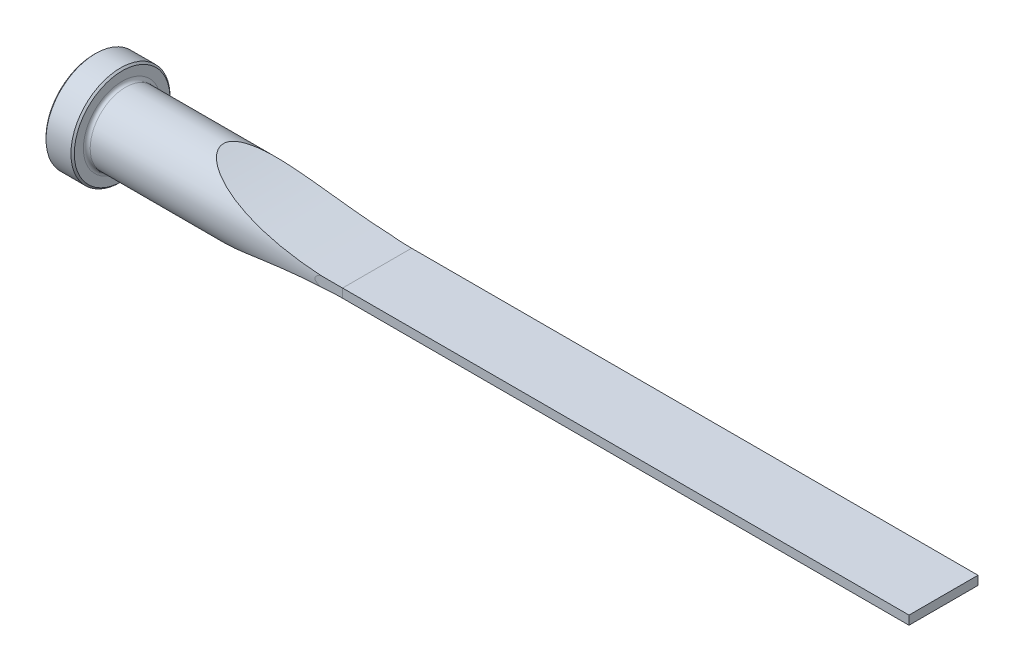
ISO-10303-21;
HEADER;
FILE_DESCRIPTION(('STEP AP214'),'2;1');
FILE_NAME('part.step','',(''),(''),'','','');
FILE_SCHEMA(('AUTOMOTIVE_DESIGN { 1 0 10303 214 1 1 1 1 }'));
ENDSEC;
DATA;
#1=APPLICATION_CONTEXT('core data for automotive mechanical design processes');
#2=APPLICATION_PROTOCOL_DEFINITION('international standard','automotive_design',2000,#1);
#3=PRODUCT_CONTEXT('',#1,'mechanical');
#4=PRODUCT('Part','Part','',(#3));
#5=PRODUCT_RELATED_PRODUCT_CATEGORY('part','',(#4));
#6=PRODUCT_DEFINITION_FORMATION('','',#4);
#7=PRODUCT_DEFINITION_CONTEXT('part definition',#1,'design');
#8=PRODUCT_DEFINITION('design','',#6,#7);
#9=PRODUCT_DEFINITION_SHAPE('','',#8);
#10=(LENGTH_UNIT() NAMED_UNIT(*) SI_UNIT(.MILLI.,.METRE.));
#11=(NAMED_UNIT(*) PLANE_ANGLE_UNIT() SI_UNIT($,.RADIAN.));
#12=(NAMED_UNIT(*) SI_UNIT($,.STERADIAN.) SOLID_ANGLE_UNIT());
#13=UNCERTAINTY_MEASURE_WITH_UNIT(LENGTH_MEASURE(1.E-05),#10,'distance_accuracy_value','');
#14=(GEOMETRIC_REPRESENTATION_CONTEXT(3) GLOBAL_UNCERTAINTY_ASSIGNED_CONTEXT((#13)) GLOBAL_UNIT_ASSIGNED_CONTEXT((#10,
#11,#12)) REPRESENTATION_CONTEXT('',''));
#15=CARTESIAN_POINT('',(0.,0.,0.));
#16=DIRECTION('',(0.,0.,1.));
#17=DIRECTION('',(1.,0.,0.));
#18=AXIS2_PLACEMENT_3D('',#15,#16,#17);
#19=CARTESIAN_POINT('',(0.,0.,0.));
#20=DIRECTION('',(-1.,0.,0.));
#21=DIRECTION('',(0.,0.,1.));
#22=AXIS2_PLACEMENT_3D('',#19,#20,#21);
#23=CYLINDRICAL_SURFACE('',#22,7.9375);
#24=CARTESIAN_POINT('',(7.112,0.,0.));
#25=DIRECTION('',(-1.,0.,0.));
#26=DIRECTION('',(0.,0.,1.));
#27=AXIS2_PLACEMENT_3D('',#24,#25,#26);
#28=CIRCLE('',#27,7.9375);
#29=CARTESIAN_POINT('',(7.112,0.,7.9375));
#30=VERTEX_POINT('',#29);
#31=EDGE_CURVE('E153',#30,#30,#28,.F.);
#32=ORIENTED_EDGE('',*,*,#31,.T.);
#33=EDGE_LOOP('',(#32));
#34=FACE_BOUND('',#33,.T.);
#35=CARTESIAN_POINT('',(63.5,1.78451947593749,7.73429999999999));
#36=CARTESIAN_POINT('',(63.3430656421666,1.78451054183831,7.73429977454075));
#37=CARTESIAN_POINT('',(63.1861350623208,1.78271922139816,7.73471557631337));
#38=CARTESIAN_POINT('',(62.8723492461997,1.77549817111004,7.73637727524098));
#39=CARTESIAN_POINT('',(62.7154940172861,1.77006813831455,7.73762324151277));
#40=CARTESIAN_POINT('',(62.2441822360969,1.74816345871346,7.74261393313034));
#41=CARTESIAN_POINT('',(61.9299817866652,1.72607327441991,7.74761144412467));
#42=CARTESIAN_POINT('',(61.2899690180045,1.66408626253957,7.76117477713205));
#43=CARTESIAN_POINT('',(60.9642250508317,1.62347858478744,7.76988203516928));
#44=CARTESIAN_POINT('',(60.4785569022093,1.5460805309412,7.78551205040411));
#45=CARTESIAN_POINT('',(60.3172623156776,1.51755721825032,7.79114576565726));
#46=CARTESIAN_POINT('',(59.995978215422,1.45411431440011,7.80323762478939));
#47=CARTESIAN_POINT('',(59.8359884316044,1.41919608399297,7.80969559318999));
#48=CARTESIAN_POINT('',(59.5504331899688,1.34959366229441,7.82198684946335));
#49=CARTESIAN_POINT('',(59.4245187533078,1.31632189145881,7.82767781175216));
#50=CARTESIAN_POINT('',(59.1742906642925,1.24389463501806,7.83951454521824));
#51=CARTESIAN_POINT('',(59.0499782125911,1.20473498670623,7.84566063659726));
#52=CARTESIAN_POINT('',(58.8046106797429,1.11932874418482,7.85829914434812));
#53=CARTESIAN_POINT('',(58.6835409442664,1.07312433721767,7.86478935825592));
#54=CARTESIAN_POINT('',(58.4455290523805,0.971242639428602,7.87802451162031));
#55=CARTESIAN_POINT('',(58.3285807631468,0.915580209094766,7.88476903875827));
#56=CARTESIAN_POINT('',(58.1332020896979,0.807942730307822,7.89640344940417));
#57=CARTESIAN_POINT('',(58.0530253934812,0.759165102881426,7.90129316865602));
#58=CARTESIAN_POINT('',(57.8993862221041,0.652026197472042,7.9108592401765));
#59=CARTESIAN_POINT('',(57.8258979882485,0.593704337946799,7.91553637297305));
#60=CARTESIAN_POINT('',(57.7277467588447,0.498492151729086,7.9218877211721));
#61=CARTESIAN_POINT('',(57.6980303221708,0.466875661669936,7.92382750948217));
#62=CARTESIAN_POINT('',(57.6425603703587,0.400245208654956,7.92747295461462));
#63=CARTESIAN_POINT('',(57.6168066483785,0.365231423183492,7.92917862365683));
#64=CARTESIAN_POINT('',(57.5744097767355,0.297054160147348,7.93200146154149));
#65=CARTESIAN_POINT('',(57.5569814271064,0.264389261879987,7.9331684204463));
#66=CARTESIAN_POINT('',(57.5276907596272,0.196640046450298,7.93513574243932));
#67=CARTESIAN_POINT('',(57.5158172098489,0.161560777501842,7.9359368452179));
#68=CARTESIAN_POINT('',(57.5003815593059,0.0956953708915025,7.93697969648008));
#69=CARTESIAN_POINT('',(57.4957692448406,0.0651593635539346,7.93729206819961));
#70=CARTESIAN_POINT('',(57.491836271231,0.00374737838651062,7.93755838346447));
#71=CARTESIAN_POINT('',(57.4925133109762,-0.0271284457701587,7.9375124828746));
#72=CARTESIAN_POINT('',(57.4990749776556,-0.0882381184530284,7.93706831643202));
#73=CARTESIAN_POINT('',(57.5049486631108,-0.118473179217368,7.936670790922));
#74=CARTESIAN_POINT('',(57.5213031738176,-0.177660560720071,7.93556691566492));
#75=CARTESIAN_POINT('',(57.5317886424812,-0.206611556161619,7.9348602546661));
#76=CARTESIAN_POINT('',(57.5626598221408,-0.276684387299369,7.93278744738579));
#77=CARTESIAN_POINT('',(57.5853777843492,-0.316766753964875,7.93126793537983));
#78=CARTESIAN_POINT('',(57.6366991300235,-0.39292597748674,7.92786070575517));
#79=CARTESIAN_POINT('',(57.6653178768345,-0.428991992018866,7.92597202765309));
#80=CARTESIAN_POINT('',(57.7519576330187,-0.525999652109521,7.92030384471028));
#81=CARTESIAN_POINT('',(57.8146458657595,-0.582701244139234,7.91625752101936));
#82=CARTESIAN_POINT('',(57.946996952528,-0.687133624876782,7.90787418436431));
#83=CARTESIAN_POINT('',(58.0166818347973,-0.73483462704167,7.90353626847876));
#84=CARTESIAN_POINT('',(58.1980649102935,-0.847009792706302,7.89247512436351));
#85=CARTESIAN_POINT('',(58.3124942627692,-0.90701549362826,7.88570351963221));
#86=CARTESIAN_POINT('',(58.5463942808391,-1.0164466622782,7.87233944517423));
#87=CARTESIAN_POINT('',(58.6658758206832,-1.06584775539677,7.86574741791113));
#88=CARTESIAN_POINT('',(58.9089635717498,-1.15711870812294,7.85284174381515));
#89=CARTESIAN_POINT('',(59.0325981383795,-1.19891277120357,7.8465313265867));
#90=CARTESIAN_POINT('',(59.2816923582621,-1.27609049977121,7.83434823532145));
#91=CARTESIAN_POINT('',(59.4071499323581,-1.31148093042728,7.82847510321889));
#92=CARTESIAN_POINT('',(59.6993409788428,-1.38743337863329,7.81542475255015));
#93=CARTESIAN_POINT('',(59.8665757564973,-1.42608925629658,7.8084228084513));
#94=CARTESIAN_POINT('',(60.2026202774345,-1.49607651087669,7.79531303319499));
#95=CARTESIAN_POINT('',(60.3714304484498,-1.52740583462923,7.78920545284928));
#96=CARTESIAN_POINT('',(60.8800454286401,-1.61220099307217,7.77226680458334));
#97=CARTESIAN_POINT('',(61.2214646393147,-1.65633549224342,7.76284544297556));
#98=CARTESIAN_POINT('',(61.8861149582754,-1.72271499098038,7.74836524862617));
#99=CARTESIAN_POINT('',(62.2092344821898,-1.74609496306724,7.74308238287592));
#100=CARTESIAN_POINT('',(62.6938210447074,-1.76925595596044,7.73780942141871));
#101=CARTESIAN_POINT('',(62.8550077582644,-1.77499180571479,7.73649365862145));
#102=CARTESIAN_POINT('',(63.1774617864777,-1.78261828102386,7.73473885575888));
#103=CARTESIAN_POINT('',(63.3387290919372,-1.78450927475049,7.73429973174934));
#104=CARTESIAN_POINT('',(63.5,-1.78451947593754,7.73429999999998));
#105=B_SPLINE_CURVE_WITH_KNOTS('',3,(#35,#36,#37,#38,#39,#40,#41,#42,#43,#44,#45,#46,#47,#48,
#49,#50,#51,#52,#53,#54,#55,#56,#57,#58,#59,#60,#61,#62,#63,#64,#65,#66,#67,#68,#69,#70,#71,#72,
#73,#74,#75,#76,#77,#78,#79,#80,#81,#82,#83,#84,#85,#86,#87,#88,#89,#90,#91,#92,#93,#94,#95,#96,
#97,#98,#99,#100,#101,#102,#103,#104),.UNSPECIFIED.,.F.,.F.,(4,2,2,2,2,2,2,2,2,2,2,2,2,2,2,2,2,
2,2,2,2,2,2,2,2,2,2,2,2,2,2,2,2,2,4),(0.,0.470784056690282,0.941607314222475,1.886257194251,
2.87069717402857,3.36228091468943,3.85376017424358,4.24473219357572,4.63598193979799,
5.02497459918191,5.41336162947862,5.69491367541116,5.97533094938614,6.10540702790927,
6.23547631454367,6.34621180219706,6.45672240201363,6.54894631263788,6.64113010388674,
6.7331202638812,6.82520325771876,6.96270105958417,7.10056147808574,7.3530071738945,
7.60627419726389,7.99346510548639,8.38153665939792,8.77328533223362,9.16461769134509,
9.67975694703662,10.1950403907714,11.2273641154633,12.1989586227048,12.6827980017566,
13.1665910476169),.UNSPECIFIED.);
#106=CARTESIAN_POINT('',(58.7970394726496,1.11508444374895,7.85878444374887));
#107=VERTEX_POINT('',#106);
#108=CARTESIAN_POINT('',(58.7970394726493,-1.11508444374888,7.85878444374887));
#109=VERTEX_POINT('',#108);
#110=EDGE_CURVE('E156',#107,#109,#105,.T.);
#111=ORIENTED_EDGE('',*,*,#110,.F.);
#112=CARTESIAN_POINT('',(63.5,0.990599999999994,7.8754439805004));
#113=CARTESIAN_POINT('',(62.8367092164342,0.990598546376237,7.87539803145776));
#114=CARTESIAN_POINT('',(62.1734175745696,0.998023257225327,7.87450855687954));
#115=CARTESIAN_POINT('',(60.8471654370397,1.027714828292,7.87071326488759));
#116=CARTESIAN_POINT('',(60.1842049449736,1.04998184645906,7.86780742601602));
#117=CARTESIAN_POINT('',(58.8585953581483,1.10936428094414,7.85964784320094));
#118=CARTESIAN_POINT('',(58.1959466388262,1.14648790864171,7.85439280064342));
#119=CARTESIAN_POINT('',(56.8716784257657,1.23556206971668,7.84087600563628));
#120=CARTESIAN_POINT('',(56.2100589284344,1.28751255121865,7.83261426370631));
#121=CARTESIAN_POINT('',(54.8847773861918,1.40651744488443,7.81212374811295));
#122=CARTESIAN_POINT('',(54.2211225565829,1.47364883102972,7.79987461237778));
#123=CARTESIAN_POINT('',(52.8956050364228,1.62281646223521,7.77020977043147));
#124=CARTESIAN_POINT('',(52.2337423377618,1.70485263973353,7.75279408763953));
#125=CARTESIAN_POINT('',(50.9124394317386,1.88373867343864,7.71128161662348));
#126=CARTESIAN_POINT('',(50.2529985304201,1.98058388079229,7.68718692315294));
#127=CARTESIAN_POINT('',(48.9368236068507,2.18901625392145,7.63045191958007));
#128=CARTESIAN_POINT('',(48.2800895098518,2.30060300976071,7.59781184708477));
#129=CARTESIAN_POINT('',(47.140821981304,2.50736667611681,7.5316339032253));
#130=CARTESIAN_POINT('',(46.657542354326,2.59922942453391,7.50055200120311));
#131=CARTESIAN_POINT('',(45.6930605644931,2.79086047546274,7.43137874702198));
#132=CARTESIAN_POINT('',(45.211858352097,2.89062858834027,7.39328756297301));
#133=CARTESIAN_POINT('',(44.251620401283,3.0980238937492,7.30880978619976));
#134=CARTESIAN_POINT('',(43.7725858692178,3.20565499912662,7.26241904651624));
#135=CARTESIAN_POINT('',(42.8173515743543,3.4285934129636,7.15986832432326));
#136=CARTESIAN_POINT('',(42.3411517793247,3.54390063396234,7.10370845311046));
#137=CARTESIAN_POINT('',(41.3908811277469,3.78231096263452,6.97969485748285));
#138=CARTESIAN_POINT('',(40.9168190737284,3.9054336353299,6.91181098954));
#139=CARTESIAN_POINT('',(39.9727565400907,4.15893910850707,6.76230752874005));
#140=CARTESIAN_POINT('',(39.5027563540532,4.28932242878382,6.68068695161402));
#141=CARTESIAN_POINT('',(38.5683216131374,4.55680045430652,6.50118449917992));
#142=CARTESIAN_POINT('',(38.1038817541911,4.69388800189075,6.40331971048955));
#143=CARTESIAN_POINT('',(37.181486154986,4.9743000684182,6.18801717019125));
#144=CARTESIAN_POINT('',(36.7235290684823,5.11762326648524,6.07058354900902));
#145=CARTESIAN_POINT('',(36.0402364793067,5.33748269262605,5.87578702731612));
#146=CARTESIAN_POINT('',(35.8117252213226,5.41204203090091,5.80728075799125));
#147=CARTESIAN_POINT('',(35.3572536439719,5.56235396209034,5.66347586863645));
#148=CARTESIAN_POINT('',(35.1312931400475,5.63810646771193,5.58817774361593));
#149=CARTESIAN_POINT('',(34.6820897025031,5.79069284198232,5.42990609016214));
#150=CARTESIAN_POINT('',(34.4588504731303,5.86752793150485,5.34692318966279));
#151=CARTESIAN_POINT('',(34.0159717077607,6.02191062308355,5.17243400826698));
#152=CARTESIAN_POINT('',(33.796332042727,6.09945819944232,5.08092803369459));
#153=CARTESIAN_POINT('',(33.3632897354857,6.25423767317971,4.88911832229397));
#154=CARTESIAN_POINT('',(33.1498497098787,6.33146655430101,4.78889696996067));
#155=CARTESIAN_POINT('',(32.7282271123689,6.48581366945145,4.57769006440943));
#156=CARTESIAN_POINT('',(32.5200455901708,6.56293187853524,4.46670238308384));
#157=CARTESIAN_POINT('',(32.1108396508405,6.71621550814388,4.2327153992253));
#158=CARTESIAN_POINT('',(31.9097999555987,6.7923827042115,4.10974414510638));
#159=CARTESIAN_POINT('',(31.5163812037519,6.9430116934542,3.84981399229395));
#160=CARTESIAN_POINT('',(31.3239968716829,7.01747451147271,3.71286378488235));
#161=CARTESIAN_POINT('',(31.0168987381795,7.13750403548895,3.47431658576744));
#162=CARTESIAN_POINT('',(30.8988621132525,7.18394265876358,3.37743358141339));
#163=CARTESIAN_POINT('',(30.6684957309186,7.27511925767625,3.17627937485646));
#164=CARTESIAN_POINT('',(30.5561667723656,7.31985699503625,3.07200714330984));
#165=CARTESIAN_POINT('',(30.3386213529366,7.40698540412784,2.8555334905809));
#166=CARTESIAN_POINT('',(30.2333982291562,7.44937826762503,2.74333970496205));
#167=CARTESIAN_POINT('',(30.0316535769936,7.53107328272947,2.51039195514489));
#168=CARTESIAN_POINT('',(29.9351284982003,7.57037669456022,2.38964151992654));
#169=CARTESIAN_POINT('',(29.7184357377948,7.65901103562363,2.09185418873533));
#170=CARTESIAN_POINT('',(29.6030268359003,7.70655492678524,1.91072625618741));
#171=CARTESIAN_POINT('',(29.3995091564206,7.79079045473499,1.53135329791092));
#172=CARTESIAN_POINT('',(29.3113595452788,7.82749831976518,1.33313444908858));
#173=CARTESIAN_POINT('',(29.1825898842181,7.88127500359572,0.958459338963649));
#174=CARTESIAN_POINT('',(29.136340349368,7.90066111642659,0.784297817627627));
#175=CARTESIAN_POINT('',(29.0715916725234,7.92782806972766,0.43001484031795));
#176=CARTESIAN_POINT('',(29.0530686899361,7.9356188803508,0.249898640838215));
#177=CARTESIAN_POINT('',(29.0455549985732,7.93877728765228,-0.111437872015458));
#178=CARTESIAN_POINT('',(29.0566234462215,7.93411999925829,-0.292659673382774));
#179=CARTESIAN_POINT('',(29.1072867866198,7.91284701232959,-0.650347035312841));
#180=CARTESIAN_POINT('',(29.1469020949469,7.89622275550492,-0.82680909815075));
#181=CARTESIAN_POINT('',(29.2629907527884,7.84767250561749,-1.20959062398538));
#182=CARTESIAN_POINT('',(29.3457719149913,7.8131368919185,-1.41364149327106));
#183=CARTESIAN_POINT('',(29.5408366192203,7.73223905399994,-1.80457425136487));
#184=CARTESIAN_POINT('',(29.6531770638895,7.68585402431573,-1.99142207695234));
#185=CARTESIAN_POINT('',(29.8721592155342,7.5960735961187,-2.3074181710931));
#186=CARTESIAN_POINT('',(29.9744606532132,7.55432796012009,-2.44012749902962));
#187=CARTESIAN_POINT('',(30.1896236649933,7.46704570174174,-2.6954307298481));
#188=CARTESIAN_POINT('',(30.3024914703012,7.42150684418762,-2.81801858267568));
#189=CARTESIAN_POINT('',(30.536738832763,7.32759763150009,-3.0539097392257));
#190=CARTESIAN_POINT('',(30.6581307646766,7.2792231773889,-3.16719900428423));
#191=CARTESIAN_POINT('',(30.9076763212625,7.18045252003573,-3.38515963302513));
#192=CARTESIAN_POINT('',(31.0358325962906,7.13005552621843,-3.48982757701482));
#193=CARTESIAN_POINT('',(31.4212726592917,6.97956546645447,-3.7865569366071));
#194=CARTESIAN_POINT('',(31.6861649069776,6.87750341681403,-3.96776311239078));
#195=CARTESIAN_POINT('',(32.2302200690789,6.67103578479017,-4.30585220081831));
#196=CARTESIAN_POINT('',(32.5093967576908,6.56662799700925,-4.46271102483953));
#197=CARTESIAN_POINT('',(33.0786496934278,6.35711199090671,-4.75643046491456));
#198=CARTESIAN_POINT('',(33.3687493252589,6.25200271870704,-4.89324470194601));
#199=CARTESIAN_POINT('',(33.8095769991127,6.09493680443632,-5.08551469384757));
#200=CARTESIAN_POINT('',(33.957440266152,6.0426900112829,-5.14743668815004));
#201=CARTESIAN_POINT('',(34.2548758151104,5.93848549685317,-5.26731527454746));
#202=CARTESIAN_POINT('',(34.4044481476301,5.8865277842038,-5.32527174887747));
#203=CARTESIAN_POINT('',(34.7824145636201,5.75637249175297,-5.46639393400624));
#204=CARTESIAN_POINT('',(35.0117794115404,5.67842450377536,-5.54719284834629));
#205=CARTESIAN_POINT('',(35.4733998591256,5.52366932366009,-5.70130566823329));
#206=CARTESIAN_POINT('',(35.705655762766,5.4468622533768,-5.77461877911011));
#207=CARTESIAN_POINT('',(36.4062522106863,5.21840848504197,-5.98456770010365));
#208=CARTESIAN_POINT('',(36.878278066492,5.06877868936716,-6.11116079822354));
#209=CARTESIAN_POINT('',(37.8304026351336,4.77579215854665,-6.34275624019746));
#210=CARTESIAN_POINT('',(38.3105145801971,4.63244744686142,-6.44771851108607));
#211=CARTESIAN_POINT('',(39.2763103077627,4.35303209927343,-6.63955707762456));
#212=CARTESIAN_POINT('',(39.7619931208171,4.21696022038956,-6.7264364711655));
#213=CARTESIAN_POINT('',(40.7414562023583,3.95156312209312,-6.88572178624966));
#214=CARTESIAN_POINT('',(41.2352697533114,3.82229487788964,-6.95801656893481));
#215=CARTESIAN_POINT('',(42.226656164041,3.57190994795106,-7.08980746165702));
#216=CARTESIAN_POINT('',(42.7242291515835,3.45079354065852,-7.14930313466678));
#217=CARTESIAN_POINT('',(43.7220057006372,3.21705592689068,-7.25748028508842));
#218=CARTESIAN_POINT('',(44.222206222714,3.10442654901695,-7.30617225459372));
#219=CARTESIAN_POINT('',(45.2252509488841,2.8876871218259,-7.39451476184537));
#220=CARTESIAN_POINT('',(45.7280952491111,2.78357738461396,-7.43416496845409));
#221=CARTESIAN_POINT('',(46.9494839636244,2.541729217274,-7.52106100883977));
#222=CARTESIAN_POINT('',(47.6691864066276,2.40842257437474,-7.56441165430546));
#223=CARTESIAN_POINT('',(49.1122741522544,2.15953627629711,-7.63918584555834));
#224=CARTESIAN_POINT('',(49.8356596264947,2.04395745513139,-7.67060883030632));
#225=CARTESIAN_POINT('',(51.2857943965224,1.83061714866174,-7.72430255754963));
#226=CARTESIAN_POINT('',(52.0125453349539,1.73286557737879,-7.74656821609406));
#227=CARTESIAN_POINT('',(53.4684192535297,1.55535689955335,-7.7841503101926));
#228=CARTESIAN_POINT('',(54.1975422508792,1.47559992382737,-7.79946669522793));
#229=CARTESIAN_POINT('',(55.6399868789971,1.33585716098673,-7.82459607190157));
#230=CARTESIAN_POINT('',(56.3532646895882,1.27544026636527,-7.83453308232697));
#231=CARTESIAN_POINT('',(57.7811125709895,1.17184940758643,-7.85069558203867));
#232=CARTESIAN_POINT('',(58.4956826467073,1.12867550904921,-7.85692105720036));
#233=CARTESIAN_POINT('',(59.9250100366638,1.05963193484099,-7.86653071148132));
#234=CARTESIAN_POINT('',(60.6397665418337,1.03374601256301,-7.86991755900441));
#235=CARTESIAN_POINT('',(61.7121983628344,1.00785903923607,-7.87325790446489));
#236=CARTESIAN_POINT('',(62.0697257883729,1.00138703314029,-7.87408136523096));
#237=CARTESIAN_POINT('',(62.7848342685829,0.992757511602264,-7.87517298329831));
#238=CARTESIAN_POINT('',(63.1424153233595,0.990600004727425,-7.8754411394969));
#239=CARTESIAN_POINT('',(63.4999999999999,0.990599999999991,-7.8754439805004));
#240=B_SPLINE_CURVE_WITH_KNOTS('',3,(#112,#113,#114,#115,#116,#117,#118,#119,#120,#121,#122,
#123,#124,#125,#126,#127,#128,#129,#130,#131,#132,#133,#134,#135,#136,#137,#138,#139,#140,#141,
#142,#143,#144,#145,#146,#147,#148,#149,#150,#151,#152,#153,#154,#155,#156,#157,#158,#159,#160,
#161,#162,#163,#164,#165,#166,#167,#168,#169,#170,#171,#172,#173,#174,#175,#176,#177,#178,#179,
#180,#181,#182,#183,#184,#185,#186,#187,#188,#189,#190,#191,#192,#193,#194,#195,#196,#197,#198,
#199,#200,#201,#202,#203,#204,#205,#206,#207,#208,#209,#210,#211,#212,#213,#214,#215,#216,#217,
#218,#219,#220,#221,#222,#223,#224,#225,#226,#227,#228,#229,#230,#231,#232,#233,#234,#235,#236,
#237,#238,#239),.UNSPECIFIED.,.F.,.F.,(4,2,2,2,2,2,2,2,2,2,2,2,2,2,2,2,2,2,2,2,2,2,2,2,2,2,2,2,
2,2,2,2,2,2,2,2,2,2,2,2,2,2,2,2,2,2,2,2,2,2,2,2,2,2,2,2,2,2,2,2,2,2,2,4),(0.,1.98983159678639,
3.97968436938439,5.97063847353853,7.96158561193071,9.96286356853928,11.9641324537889,
13.9647743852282,15.9653606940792,17.4439981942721,18.9226002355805,20.4019431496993,
21.8812692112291,23.3644569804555,24.8477510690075,26.3294947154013,27.8109260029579,
28.5606563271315,29.3103320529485,30.0609344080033,30.8115097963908,31.5556334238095,
32.2999044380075,33.0424734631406,33.7845835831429,34.2631819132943,34.7418470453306,
35.2200569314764,35.6980707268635,36.3558379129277,37.0126149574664,37.5540056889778,
38.0949306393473,38.6369377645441,39.1793328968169,39.8443461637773,40.5106490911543,
41.0279992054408,41.545656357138,42.0640811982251,42.5827106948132,43.5913087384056,
44.6008983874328,45.6127883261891,46.1185610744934,46.6243488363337,47.3902949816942,
48.1563223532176,49.6888577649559,51.2242073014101,52.7592935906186,54.3056691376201,
55.8520974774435,57.3970173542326,58.9419938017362,61.1413024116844,63.3407144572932,
65.5413459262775,67.7419933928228,69.8894745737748,72.0369639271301,74.1824322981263,
75.2551703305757,76.3279104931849),.UNSPECIFIED.);
#241=CARTESIAN_POINT('',(58.7970394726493,1.11508444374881,-7.85878444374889));
#242=VERTEX_POINT('',#241);
#243=EDGE_CURVE('E106',#107,#242,#240,.T.);
#244=ORIENTED_EDGE('',*,*,#243,.T.);
#245=CARTESIAN_POINT('',(63.5,1.78451947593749,-7.73429999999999));
#246=CARTESIAN_POINT('',(63.3430656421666,1.78451054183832,-7.73429977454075));
#247=CARTESIAN_POINT('',(63.1861350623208,1.78271922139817,-7.73471557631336));
#248=CARTESIAN_POINT('',(62.8723492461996,1.77549817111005,-7.73637727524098));
#249=CARTESIAN_POINT('',(62.715494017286,1.77006813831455,-7.73762324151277));
#250=CARTESIAN_POINT('',(62.2441822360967,1.74816345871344,-7.74261393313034));
#251=CARTESIAN_POINT('',(61.929981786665,1.72607327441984,-7.74761144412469));
#252=CARTESIAN_POINT('',(61.2899690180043,1.66408626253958,-7.76117477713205));
#253=CARTESIAN_POINT('',(60.9642250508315,1.62347858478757,-7.76988203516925));
#254=CARTESIAN_POINT('',(60.4785569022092,1.54608053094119,-7.78551205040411));
#255=CARTESIAN_POINT('',(60.3172623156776,1.51755721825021,-7.79114576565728));
#256=CARTESIAN_POINT('',(59.995978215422,1.45411431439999,-7.80323762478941));
#257=CARTESIAN_POINT('',(59.8359884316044,1.41919608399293,-7.80969559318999));
#258=CARTESIAN_POINT('',(59.5504331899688,1.34959366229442,-7.82198684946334));
#259=CARTESIAN_POINT('',(59.4245187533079,1.31632189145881,-7.82767781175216));
#260=CARTESIAN_POINT('',(59.1742906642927,1.24389463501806,-7.83951454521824));
#261=CARTESIAN_POINT('',(59.0499782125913,1.20473498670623,-7.84566063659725));
#262=CARTESIAN_POINT('',(58.8046106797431,1.11932874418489,-7.85829914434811));
#263=CARTESIAN_POINT('',(58.6835409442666,1.07312433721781,-7.8647893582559));
#264=CARTESIAN_POINT('',(58.4455290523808,0.971242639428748,-7.87802451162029));
#265=CARTESIAN_POINT('',(58.3285807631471,0.915580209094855,-7.88476903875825));
#266=CARTESIAN_POINT('',(58.1332020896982,0.807942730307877,-7.89640344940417));
#267=CARTESIAN_POINT('',(58.0530253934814,0.759165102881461,-7.90129316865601));
#268=CARTESIAN_POINT('',(57.8993862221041,0.652026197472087,-7.91085924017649));
#269=CARTESIAN_POINT('',(57.8258979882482,0.593704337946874,-7.91553637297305));
#270=CARTESIAN_POINT('',(57.7277467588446,0.49849215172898,-7.9218877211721));
#271=CARTESIAN_POINT('',(57.6980303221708,0.46687566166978,-7.92382750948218));
#272=CARTESIAN_POINT('',(57.6425603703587,0.40024520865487,-7.92747295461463));
#273=CARTESIAN_POINT('',(57.6168066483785,0.365231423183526,-7.92917862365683));
#274=CARTESIAN_POINT('',(57.5744097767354,0.297054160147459,-7.93200146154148));
#275=CARTESIAN_POINT('',(57.5569814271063,0.264389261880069,-7.93316842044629));
#276=CARTESIAN_POINT('',(57.5276907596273,0.196640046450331,-7.93513574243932));
#277=CARTESIAN_POINT('',(57.5158172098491,0.161560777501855,-7.9359368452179));
#278=CARTESIAN_POINT('',(57.5003815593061,0.0956953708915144,-7.93697969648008));
#279=CARTESIAN_POINT('',(57.4957692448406,0.0651593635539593,-7.93729206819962));
#280=CARTESIAN_POINT('',(57.491836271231,0.00374737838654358,-7.93755838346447));
#281=CARTESIAN_POINT('',(57.4925133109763,-0.0271284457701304,-7.9375124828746));
#282=CARTESIAN_POINT('',(57.4990749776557,-0.0882381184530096,-7.93706831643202));
#283=CARTESIAN_POINT('',(57.5049486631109,-0.118473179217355,-7.936670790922));
#284=CARTESIAN_POINT('',(57.5213031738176,-0.177660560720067,-7.93556691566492));
#285=CARTESIAN_POINT('',(57.5317886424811,-0.20661155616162,-7.9348602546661));
#286=CARTESIAN_POINT('',(57.5626598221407,-0.276684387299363,-7.93278744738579));
#287=CARTESIAN_POINT('',(57.5853777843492,-0.31676675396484,-7.93126793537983));
#288=CARTESIAN_POINT('',(57.6366991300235,-0.392925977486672,-7.92786070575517));
#289=CARTESIAN_POINT('',(57.6653178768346,-0.428991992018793,-7.92597202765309));
#290=CARTESIAN_POINT('',(57.7519576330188,-0.52599965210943,-7.92030384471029));
#291=CARTESIAN_POINT('',(57.8146458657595,-0.582701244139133,-7.91625752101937));
#292=CARTESIAN_POINT('',(57.9469969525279,-0.687133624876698,-7.90787418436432));
#293=CARTESIAN_POINT('',(58.0166818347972,-0.734834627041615,-7.90353626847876));
#294=CARTESIAN_POINT('',(58.1980649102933,-0.847009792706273,-7.89247512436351));
#295=CARTESIAN_POINT('',(58.3124942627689,-0.907015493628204,-7.88570351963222));
#296=CARTESIAN_POINT('',(58.5463942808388,-1.01644666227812,-7.87233944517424));
#297=CARTESIAN_POINT('',(58.6658758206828,-1.06584775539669,-7.86574741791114));
#298=CARTESIAN_POINT('',(58.9089635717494,-1.15711870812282,-7.85284174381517));
#299=CARTESIAN_POINT('',(59.0325981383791,-1.1989127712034,-7.84653132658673));
#300=CARTESIAN_POINT('',(59.2816923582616,-1.27609049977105,-7.83434823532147));
#301=CARTESIAN_POINT('',(59.4071499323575,-1.31148093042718,-7.82847510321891));
#302=CARTESIAN_POINT('',(59.6993409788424,-1.38743337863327,-7.81542475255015));
#303=CARTESIAN_POINT('',(59.8665757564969,-1.42608925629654,-7.80842280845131));
#304=CARTESIAN_POINT('',(60.2026202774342,-1.49607651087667,-7.79531303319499));
#305=CARTESIAN_POINT('',(60.3714304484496,-1.52740583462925,-7.78920545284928));
#306=CARTESIAN_POINT('',(60.8800454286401,-1.61220099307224,-7.77226680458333));
#307=CARTESIAN_POINT('',(61.2214646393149,-1.65633549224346,-7.76284544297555));
#308=CARTESIAN_POINT('',(61.8861149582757,-1.72271499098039,-7.74836524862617));
#309=CARTESIAN_POINT('',(62.2092344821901,-1.74609496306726,-7.74308238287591));
#310=CARTESIAN_POINT('',(62.6938210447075,-1.76925595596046,-7.7378094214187));
#311=CARTESIAN_POINT('',(62.8550077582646,-1.7749918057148,-7.73649365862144));
#312=CARTESIAN_POINT('',(63.1774617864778,-1.78261828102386,-7.73473885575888));
#313=CARTESIAN_POINT('',(63.3387290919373,-1.78450927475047,-7.73429973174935));
#314=CARTESIAN_POINT('',(63.5,-1.78451947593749,-7.73429999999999));
#315=B_SPLINE_CURVE_WITH_KNOTS('',3,(#245,#246,#247,#248,#249,#250,#251,#252,#253,#254,#255,
#256,#257,#258,#259,#260,#261,#262,#263,#264,#265,#266,#267,#268,#269,#270,#271,#272,#273,#274,
#275,#276,#277,#278,#279,#280,#281,#282,#283,#284,#285,#286,#287,#288,#289,#290,#291,#292,#293,
#294,#295,#296,#297,#298,#299,#300,#301,#302,#303,#304,#305,#306,#307,#308,#309,#310,#311,#312,
#313,#314),.UNSPECIFIED.,.F.,.F.,(4,2,2,2,2,2,2,2,2,2,2,2,2,2,2,2,2,2,2,2,2,2,2,2,2,2,2,2,2,2,2,
2,2,2,4),(0.,0.470784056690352,0.9416073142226,1.88625719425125,2.8706971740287,
3.36228091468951,3.8537601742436,4.24473219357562,4.63598193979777,5.02497459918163,
5.41336162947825,5.69491367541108,5.97533094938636,6.10540702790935,6.2354763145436,
6.34621180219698,6.45672240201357,6.54894631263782,6.6411301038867,6.73312026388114,
6.82520325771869,6.96270105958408,7.10056147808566,7.35300717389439,7.60627419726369,
7.99346510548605,8.38153665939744,8.77328533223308,9.16461769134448,9.67975694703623,
10.1950403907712,11.2273641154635,12.198958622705,12.6827980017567,13.1665910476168),.UNSPECIFIED.);
#316=CARTESIAN_POINT('',(58.7970394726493,-1.11508444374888,-7.85878444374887));
#317=VERTEX_POINT('',#316);
#318=EDGE_CURVE('E175',#242,#317,#315,.T.);
#319=ORIENTED_EDGE('',*,*,#318,.T.);
#320=CARTESIAN_POINT('',(63.5,-0.990599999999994,7.8754439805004));
#321=CARTESIAN_POINT('',(62.8367092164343,-0.990598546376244,7.87539803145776));
#322=CARTESIAN_POINT('',(62.1734175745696,-0.998023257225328,7.87450855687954));
#323=CARTESIAN_POINT('',(60.8471654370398,-1.02771482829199,7.87071326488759));
#324=CARTESIAN_POINT('',(60.1842049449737,-1.04998184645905,7.86780742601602));
#325=CARTESIAN_POINT('',(58.8585953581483,-1.10936428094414,7.85964784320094));
#326=CARTESIAN_POINT('',(58.1959466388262,-1.14648790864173,7.85439280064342));
#327=CARTESIAN_POINT('',(56.8716784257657,-1.2355620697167,7.84087600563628));
#328=CARTESIAN_POINT('',(56.2100589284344,-1.28751255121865,7.83261426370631));
#329=CARTESIAN_POINT('',(54.8847773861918,-1.40651744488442,7.81212374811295));
#330=CARTESIAN_POINT('',(54.2211225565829,-1.47364883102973,7.79987461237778));
#331=CARTESIAN_POINT('',(52.8956050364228,-1.62281646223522,7.77020977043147));
#332=CARTESIAN_POINT('',(52.2337423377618,-1.70485263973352,7.75279408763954));
#333=CARTESIAN_POINT('',(50.9124394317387,-1.88373867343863,7.71128161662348));
#334=CARTESIAN_POINT('',(50.2529985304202,-1.9805838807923,7.68718692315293));
#335=CARTESIAN_POINT('',(48.9368236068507,-2.18901625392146,7.63045191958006));
#336=CARTESIAN_POINT('',(48.2800895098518,-2.3006030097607,7.59781184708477));
#337=CARTESIAN_POINT('',(47.140821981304,-2.5073666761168,7.5316339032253));
#338=CARTESIAN_POINT('',(46.657542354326,-2.59922942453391,7.50055200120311));
#339=CARTESIAN_POINT('',(45.6930605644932,-2.79086047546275,7.43137874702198));
#340=CARTESIAN_POINT('',(45.211858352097,-2.89062858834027,7.39328756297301));
#341=CARTESIAN_POINT('',(44.251620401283,-3.0980238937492,7.30880978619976));
#342=CARTESIAN_POINT('',(43.7725858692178,-3.20565499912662,7.26241904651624));
#343=CARTESIAN_POINT('',(42.8173515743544,-3.42859341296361,7.15986832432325));
#344=CARTESIAN_POINT('',(42.3411517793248,-3.54390063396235,7.10370845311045));
#345=CARTESIAN_POINT('',(41.3908811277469,-3.78231096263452,6.97969485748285));
#346=CARTESIAN_POINT('',(40.9168190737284,-3.90543363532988,6.91181098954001));
#347=CARTESIAN_POINT('',(39.9727565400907,-4.15893910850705,6.76230752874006));
#348=CARTESIAN_POINT('',(39.5027563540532,-4.28932242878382,6.68068695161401));
#349=CARTESIAN_POINT('',(38.5683216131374,-4.55680045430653,6.50118449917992));
#350=CARTESIAN_POINT('',(38.1038817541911,-4.69388800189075,6.40331971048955));
#351=CARTESIAN_POINT('',(37.181486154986,-4.9743000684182,6.18801717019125));
#352=CARTESIAN_POINT('',(36.7235290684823,-5.11762326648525,6.07058354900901));
#353=CARTESIAN_POINT('',(36.0402364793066,-5.33748269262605,5.87578702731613));
#354=CARTESIAN_POINT('',(35.8117252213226,-5.4120420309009,5.80728075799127));
#355=CARTESIAN_POINT('',(35.3572536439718,-5.56235396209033,5.66347586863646));
#356=CARTESIAN_POINT('',(35.1312931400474,-5.63810646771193,5.58817774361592));
#357=CARTESIAN_POINT('',(34.6820897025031,-5.79069284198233,5.42990609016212));
#358=CARTESIAN_POINT('',(34.4588504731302,-5.86752793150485,5.34692318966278));
#359=CARTESIAN_POINT('',(34.0159717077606,-6.02191062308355,5.17243400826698));
#360=CARTESIAN_POINT('',(33.7963320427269,-6.09945819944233,5.08092803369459));
#361=CARTESIAN_POINT('',(33.3632897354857,-6.25423767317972,4.88911832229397));
#362=CARTESIAN_POINT('',(33.1498497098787,-6.33146655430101,4.78889696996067));
#363=CARTESIAN_POINT('',(32.7282271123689,-6.48581366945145,4.57769006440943));
#364=CARTESIAN_POINT('',(32.5200455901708,-6.56293187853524,4.46670238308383));
#365=CARTESIAN_POINT('',(32.1108396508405,-6.71621550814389,4.23271539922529));
#366=CARTESIAN_POINT('',(31.9097999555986,-6.7923827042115,4.10974414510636));
#367=CARTESIAN_POINT('',(31.5163812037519,-6.94301169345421,3.84981399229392));
#368=CARTESIAN_POINT('',(31.3239968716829,-7.01747451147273,3.71286378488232));
#369=CARTESIAN_POINT('',(31.0168987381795,-7.13750403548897,3.4743165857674));
#370=CARTESIAN_POINT('',(30.8988621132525,-7.1839426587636,3.37743358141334));
#371=CARTESIAN_POINT('',(30.6684957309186,-7.27511925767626,3.17627937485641));
#372=CARTESIAN_POINT('',(30.5561667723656,-7.31985699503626,3.07200714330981));
#373=CARTESIAN_POINT('',(30.3386213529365,-7.40698540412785,2.85553349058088));
#374=CARTESIAN_POINT('',(30.2333982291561,-7.44937826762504,2.74333970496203));
#375=CARTESIAN_POINT('',(30.0316535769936,-7.53107328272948,2.51039195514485));
#376=CARTESIAN_POINT('',(29.9351284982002,-7.57037669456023,2.3896415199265));
#377=CARTESIAN_POINT('',(29.7184357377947,-7.65901103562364,2.09185418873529));
#378=CARTESIAN_POINT('',(29.6030268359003,-7.70655492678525,1.91072625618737));
#379=CARTESIAN_POINT('',(29.3995091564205,-7.790790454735,1.53135329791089));
#380=CARTESIAN_POINT('',(29.3113595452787,-7.82749831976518,1.33313444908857));
#381=CARTESIAN_POINT('',(29.182589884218,-7.88127500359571,0.958459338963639));
#382=CARTESIAN_POINT('',(29.136340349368,-7.90066111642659,0.784297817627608));
#383=CARTESIAN_POINT('',(29.0715916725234,-7.92782806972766,0.430014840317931));
#384=CARTESIAN_POINT('',(29.053068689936,-7.9356188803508,0.249898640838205));
#385=CARTESIAN_POINT('',(29.0455549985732,-7.93877728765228,-0.111437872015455));
#386=CARTESIAN_POINT('',(29.0566234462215,-7.93411999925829,-0.292659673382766));
#387=CARTESIAN_POINT('',(29.1072867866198,-7.91284701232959,-0.650347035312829));
#388=CARTESIAN_POINT('',(29.1469020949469,-7.89622275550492,-0.826809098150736));
#389=CARTESIAN_POINT('',(29.2629907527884,-7.84767250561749,-1.20959062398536));
#390=CARTESIAN_POINT('',(29.3457719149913,-7.81313689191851,-1.41364149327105));
#391=CARTESIAN_POINT('',(29.5408366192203,-7.73223905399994,-1.80457425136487));
#392=CARTESIAN_POINT('',(29.6531770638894,-7.68585402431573,-1.99142207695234));
#393=CARTESIAN_POINT('',(29.8721592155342,-7.5960735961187,-2.30741817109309));
#394=CARTESIAN_POINT('',(29.9744606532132,-7.5543279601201,-2.44012749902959));
#395=CARTESIAN_POINT('',(30.1896236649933,-7.46704570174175,-2.69543072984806));
#396=CARTESIAN_POINT('',(30.3024914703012,-7.42150684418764,-2.81801858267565));
#397=CARTESIAN_POINT('',(30.536738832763,-7.3275976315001,-3.05390973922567));
#398=CARTESIAN_POINT('',(30.6581307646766,-7.27922317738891,-3.16719900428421));
#399=CARTESIAN_POINT('',(30.9076763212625,-7.18045252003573,-3.38515963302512));
#400=CARTESIAN_POINT('',(31.0358325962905,-7.13005552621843,-3.48982757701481));
#401=CARTESIAN_POINT('',(31.4212726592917,-6.97956546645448,-3.78655693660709));
#402=CARTESIAN_POINT('',(31.6861649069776,-6.87750341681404,-3.96776311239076));
#403=CARTESIAN_POINT('',(32.2302200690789,-6.67103578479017,-4.3058522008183));
#404=CARTESIAN_POINT('',(32.5093967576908,-6.56662799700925,-4.46271102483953));
#405=CARTESIAN_POINT('',(33.0786496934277,-6.35711199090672,-4.75643046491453));
#406=CARTESIAN_POINT('',(33.3687493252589,-6.25200271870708,-4.89324470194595));
#407=CARTESIAN_POINT('',(33.8095769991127,-6.09493680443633,-5.08551469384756));
#408=CARTESIAN_POINT('',(33.957440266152,-6.04269001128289,-5.14743668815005));
#409=CARTESIAN_POINT('',(34.2548758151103,-5.93848549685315,-5.26731527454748));
#410=CARTESIAN_POINT('',(34.4044481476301,-5.8865277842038,-5.32527174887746));
#411=CARTESIAN_POINT('',(34.78241456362,-5.756372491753,-5.46639393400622));
#412=CARTESIAN_POINT('',(35.0117794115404,-5.67842450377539,-5.54719284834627));
#413=CARTESIAN_POINT('',(35.4733998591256,-5.5236693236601,-5.70130566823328));
#414=CARTESIAN_POINT('',(35.705655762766,-5.44686225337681,-5.7746187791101));
#415=CARTESIAN_POINT('',(36.4062522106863,-5.21840848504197,-5.98456770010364));
#416=CARTESIAN_POINT('',(36.8782780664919,-5.06877868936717,-6.11116079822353));
#417=CARTESIAN_POINT('',(37.8304026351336,-4.77579215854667,-6.34275624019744));
#418=CARTESIAN_POINT('',(38.3105145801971,-4.63244744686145,-6.44771851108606));
#419=CARTESIAN_POINT('',(39.2763103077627,-4.35303209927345,-6.63955707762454));
#420=CARTESIAN_POINT('',(39.7619931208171,-4.21696022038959,-6.72643647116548));
#421=CARTESIAN_POINT('',(40.7414562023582,-3.95156312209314,-6.88572178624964));
#422=CARTESIAN_POINT('',(41.2352697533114,-3.82229487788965,-6.9580165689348));
#423=CARTESIAN_POINT('',(42.2266561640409,-3.57190994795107,-7.08980746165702));
#424=CARTESIAN_POINT('',(42.7242291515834,-3.45079354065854,-7.14930313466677));
#425=CARTESIAN_POINT('',(43.7220057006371,-3.2170559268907,-7.25748028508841));
#426=CARTESIAN_POINT('',(44.2222062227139,-3.10442654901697,-7.30617225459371));
#427=CARTESIAN_POINT('',(45.225250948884,-2.88768712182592,-7.39451476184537));
#428=CARTESIAN_POINT('',(45.728095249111,-2.78357738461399,-7.43416496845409));
#429=CARTESIAN_POINT('',(46.9494839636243,-2.54172921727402,-7.52106100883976));
#430=CARTESIAN_POINT('',(47.6691864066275,-2.40842257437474,-7.56441165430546));
#431=CARTESIAN_POINT('',(49.1122741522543,-2.15953627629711,-7.63918584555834));
#432=CARTESIAN_POINT('',(49.8356596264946,-2.0439574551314,-7.67060883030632));
#433=CARTESIAN_POINT('',(51.2857943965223,-1.83061714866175,-7.72430255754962));
#434=CARTESIAN_POINT('',(52.0125453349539,-1.73286557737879,-7.74656821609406));
#435=CARTESIAN_POINT('',(53.4684192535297,-1.55535689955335,-7.7841503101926));
#436=CARTESIAN_POINT('',(54.1975422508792,-1.47559992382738,-7.79946669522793));
#437=CARTESIAN_POINT('',(55.6399868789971,-1.33585716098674,-7.82459607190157));
#438=CARTESIAN_POINT('',(56.3532646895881,-1.27544026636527,-7.83453308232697));
#439=CARTESIAN_POINT('',(57.7811125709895,-1.17184940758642,-7.85069558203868));
#440=CARTESIAN_POINT('',(58.4956826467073,-1.1286755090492,-7.85692105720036));
#441=CARTESIAN_POINT('',(59.9250100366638,-1.05963193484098,-7.86653071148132));
#442=CARTESIAN_POINT('',(60.6397665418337,-1.03374601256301,-7.86991755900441));
#443=CARTESIAN_POINT('',(61.7121983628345,-1.00785903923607,-7.87325790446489));
#444=CARTESIAN_POINT('',(62.069725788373,-1.0013870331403,-7.87408136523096));
#445=CARTESIAN_POINT('',(62.784834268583,-0.992757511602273,-7.87517298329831));
#446=CARTESIAN_POINT('',(63.1424153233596,-0.990600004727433,-7.8754411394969));
#447=CARTESIAN_POINT('',(63.5,-0.990599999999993,-7.8754439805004));
#448=B_SPLINE_CURVE_WITH_KNOTS('',3,(#320,#321,#322,#323,#324,#325,#326,#327,#328,#329,#330,
#331,#332,#333,#334,#335,#336,#337,#338,#339,#340,#341,#342,#343,#344,#345,#346,#347,#348,#349,
#350,#351,#352,#353,#354,#355,#356,#357,#358,#359,#360,#361,#362,#363,#364,#365,#366,#367,#368,
#369,#370,#371,#372,#373,#374,#375,#376,#377,#378,#379,#380,#381,#382,#383,#384,#385,#386,#387,
#388,#389,#390,#391,#392,#393,#394,#395,#396,#397,#398,#399,#400,#401,#402,#403,#404,#405,#406,
#407,#408,#409,#410,#411,#412,#413,#414,#415,#416,#417,#418,#419,#420,#421,#422,#423,#424,#425,
#426,#427,#428,#429,#430,#431,#432,#433,#434,#435,#436,#437,#438,#439,#440,#441,#442,#443,#444,
#445,#446,#447),.UNSPECIFIED.,.F.,.F.,(4,2,2,2,2,2,2,2,2,2,2,2,2,2,2,2,2,2,2,2,2,2,2,2,2,2,2,2,
2,2,2,2,2,2,2,2,2,2,2,2,2,2,2,2,2,2,2,2,2,2,2,2,2,2,2,2,2,2,2,2,2,2,2,4),(0.,1.98983159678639,
3.97968436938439,5.97063847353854,7.96158561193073,9.9628635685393,11.9641324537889,
13.9647743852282,15.9653606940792,17.4439981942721,18.9226002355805,20.4019431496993,
21.8812692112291,23.3644569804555,24.8477510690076,26.3294947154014,27.810926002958,
28.5606563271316,29.3103320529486,30.0609344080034,30.811509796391,31.5556334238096,
32.2999044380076,33.0424734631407,33.784583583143,34.2631819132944,34.7418470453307,
35.2200569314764,35.6980707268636,36.3558379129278,37.0126149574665,37.5540056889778,
38.0949306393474,38.6369377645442,39.1793328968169,39.8443461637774,40.5106490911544,
41.0279992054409,41.545656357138,42.0640811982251,42.5827106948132,43.5913087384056,
44.6008983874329,45.6127883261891,46.1185610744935,46.6243488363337,47.3902949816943,
48.1563223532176,49.6888577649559,51.2242073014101,52.7592935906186,54.3056691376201,
55.8520974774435,57.3970173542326,58.9419938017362,61.1413024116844,63.3407144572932,
65.5413459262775,67.7419933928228,69.8894745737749,72.0369639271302,74.1824322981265,
75.2551703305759,76.3279104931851),.UNSPECIFIED.);
#449=EDGE_CURVE('E105',#109,#317,#448,.T.);
#450=ORIENTED_EDGE('',*,*,#449,.F.);
#451=EDGE_LOOP('',(#111,#244,#319,#450));
#452=FACE_BOUND('',#451,.T.);
#453=ADVANCED_FACE('F33',(#34,#452),#23,.T.);
#454=CARTESIAN_POINT('',(190.5,7.9375,0.));
#455=DIRECTION('',(-1.,0.,0.));
#456=DIRECTION('',(0.,0.,1.));
#457=AXIS2_PLACEMENT_3D('',#454,#455,#456);
#458=PLANE('',#457);
#459=DIRECTION('',(0.,1.,0.));
#460=VECTOR('',#459,1.);
#461=CARTESIAN_POINT('',(190.5,-11.1125,7.7343));
#462=LINE('',#461,#460);
#463=CARTESIAN_POINT('',(190.5,-0.990600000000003,7.7343));
#464=VERTEX_POINT('',#463);
#465=CARTESIAN_POINT('',(190.5,0.990600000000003,7.7343));
#466=VERTEX_POINT('',#465);
#467=EDGE_CURVE('E87',#464,#466,#462,.T.);
#468=ORIENTED_EDGE('',*,*,#467,.F.);
#469=DIRECTION('',(0.,0.,1.));
#470=VECTOR('',#469,1.);
#471=CARTESIAN_POINT('',(190.5,-0.990600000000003,0.));
#472=LINE('',#471,#470);
#473=CARTESIAN_POINT('',(190.5,-0.990600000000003,-7.73429999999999));
#474=VERTEX_POINT('',#473);
#475=EDGE_CURVE('E100',#474,#464,#472,.T.);
#476=ORIENTED_EDGE('',*,*,#475,.F.);
#477=DIRECTION('',(0.,1.,0.));
#478=VECTOR('',#477,1.);
#479=CARTESIAN_POINT('',(190.5,-11.1125,-7.7343));
#480=LINE('',#479,#478);
#481=CARTESIAN_POINT('',(190.5,0.990599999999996,-7.7343));
#482=VERTEX_POINT('',#481);
#483=EDGE_CURVE('E56',#474,#482,#480,.T.);
#484=ORIENTED_EDGE('',*,*,#483,.T.);
#485=DIRECTION('',(0.,0.,1.));
#486=VECTOR('',#485,1.);
#487=CARTESIAN_POINT('',(190.5,0.990600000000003,0.));
#488=LINE('',#487,#486);
#489=EDGE_CURVE('E102',#482,#466,#488,.T.);
#490=ORIENTED_EDGE('',*,*,#489,.T.);
#491=EDGE_LOOP('',(#468,#476,#484,#490));
#492=FACE_BOUND('',#491,.T.);
#493=ADVANCED_FACE('F99',(#492),#458,.F.);
#494=CARTESIAN_POINT('',(63.5,89.8906,-11.1125));
#495=DIRECTION('',(0.,0.,1.));
#496=DIRECTION('',(1.,0.,0.));
#497=AXIS2_PLACEMENT_3D('',#494,#495,#496);
#498=CYLINDRICAL_SURFACE('',#497,88.9);
#499=CARTESIAN_POINT('',(63.5,89.8906,96.6343));
#500=DIRECTION('',(0.,-0.707106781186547,0.707106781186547));
#501=DIRECTION('',(0.,0.707106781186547,0.707106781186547));
#502=AXIS2_PLACEMENT_3D('',#499,#500,#501);
#503=ELLIPSE('',#502,125.723585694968,88.9);
#504=CARTESIAN_POINT('',(63.5,0.990599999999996,7.73429999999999));
#505=VERTEX_POINT('',#504);
#506=EDGE_CURVE('E162',#505,#107,#503,.F.);
#507=ORIENTED_EDGE('',*,*,#506,.F.);
#508=DIRECTION('',(0.,0.,1.));
#509=VECTOR('',#508,1.);
#510=CARTESIAN_POINT('',(63.5,0.990599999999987,-11.1125));
#511=LINE('',#510,#509);
#512=CARTESIAN_POINT('',(63.5,0.990599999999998,-7.73429999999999));
#513=VERTEX_POINT('',#512);
#514=EDGE_CURVE('E170',#513,#505,#511,.T.);
#515=ORIENTED_EDGE('',*,*,#514,.F.);
#516=CARTESIAN_POINT('',(63.5,89.8906,-96.6343));
#517=DIRECTION('',(0.,0.707106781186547,0.707106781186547));
#518=DIRECTION('',(0.,-0.707106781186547,0.707106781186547));
#519=AXIS2_PLACEMENT_3D('',#516,#517,#518);
#520=ELLIPSE('',#519,125.723585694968,88.9);
#521=EDGE_CURVE('E169',#513,#242,#520,.F.);
#522=ORIENTED_EDGE('',*,*,#521,.T.);
#523=ORIENTED_EDGE('',*,*,#243,.F.);
#524=EDGE_LOOP('',(#507,#515,#522,#523));
#525=FACE_BOUND('',#524,.T.);
#526=ADVANCED_FACE('F138',(#525),#498,.F.);
#527=CARTESIAN_POINT('',(190.5,0.990600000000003,-11.1125));
#528=DIRECTION('',(0.,-1.,0.));
#529=DIRECTION('',(1.,0.,0.));
#530=AXIS2_PLACEMENT_3D('',#527,#528,#529);
#531=PLANE('',#530);
#532=DIRECTION('',(-1.,0.,0.));
#533=VECTOR('',#532,1.);
#534=CARTESIAN_POINT('',(190.5,0.990600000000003,7.7343));
#535=LINE('',#534,#533);
#536=EDGE_CURVE('E188',#466,#505,#535,.T.);
#537=ORIENTED_EDGE('',*,*,#536,.F.);
#538=ORIENTED_EDGE('',*,*,#489,.F.);
#539=DIRECTION('',(-1.,0.,0.));
#540=VECTOR('',#539,1.);
#541=CARTESIAN_POINT('',(190.5,0.990600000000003,-7.7343));
#542=LINE('',#541,#540);
#543=EDGE_CURVE('E174',#482,#513,#542,.T.);
#544=ORIENTED_EDGE('',*,*,#543,.T.);
#545=ORIENTED_EDGE('',*,*,#514,.T.);
#546=EDGE_LOOP('',(#537,#538,#544,#545));
#547=FACE_BOUND('',#546,.T.);
#548=ADVANCED_FACE('F129',(#547),#531,.F.);
#549=CARTESIAN_POINT('',(63.5,-89.8906,-11.1125));
#550=DIRECTION('',(0.,0.,1.));
#551=DIRECTION('',(1.,0.,0.));
#552=AXIS2_PLACEMENT_3D('',#549,#550,#551);
#553=CYLINDRICAL_SURFACE('',#552,88.9);
#554=DIRECTION('',(0.,0.,1.));
#555=VECTOR('',#554,1.);
#556=CARTESIAN_POINT('',(63.5,-0.990599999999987,-11.1125));
#557=LINE('',#556,#555);
#558=CARTESIAN_POINT('',(63.5,-0.990599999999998,-7.73429999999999));
#559=VERTEX_POINT('',#558);
#560=CARTESIAN_POINT('',(63.5,-0.990599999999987,7.73429999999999));
#561=VERTEX_POINT('',#560);
#562=EDGE_CURVE('E178',#559,#561,#557,.T.);
#563=ORIENTED_EDGE('',*,*,#562,.T.);
#564=CARTESIAN_POINT('',(63.5,-89.8906,96.6343));
#565=DIRECTION('',(0.,0.707106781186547,0.707106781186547));
#566=DIRECTION('',(0.,-0.707106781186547,0.707106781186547));
#567=AXIS2_PLACEMENT_3D('',#564,#565,#566);
#568=ELLIPSE('',#567,125.723585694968,88.9);
#569=EDGE_CURVE('E163',#561,#109,#568,.T.);
#570=ORIENTED_EDGE('',*,*,#569,.T.);
#571=ORIENTED_EDGE('',*,*,#449,.T.);
#572=CARTESIAN_POINT('',(63.5,-89.8906,-96.6343));
#573=DIRECTION('',(0.,-0.707106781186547,0.707106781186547));
#574=DIRECTION('',(0.,0.707106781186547,0.707106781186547));
#575=AXIS2_PLACEMENT_3D('',#572,#573,#574);
#576=ELLIPSE('',#575,125.723585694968,88.9);
#577=EDGE_CURVE('E180',#559,#317,#576,.T.);
#578=ORIENTED_EDGE('',*,*,#577,.F.);
#579=EDGE_LOOP('',(#563,#570,#571,#578));
#580=FACE_BOUND('',#579,.T.);
#581=ADVANCED_FACE('F124',(#580),#553,.F.);
#582=CARTESIAN_POINT('',(190.5,-0.990600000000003,-11.1125));
#583=DIRECTION('',(0.,-1.,0.));
#584=DIRECTION('',(1.,0.,0.));
#585=AXIS2_PLACEMENT_3D('',#582,#583,#584);
#586=PLANE('',#585);
#587=ORIENTED_EDGE('',*,*,#475,.T.);
#588=DIRECTION('',(-1.,0.,0.));
#589=VECTOR('',#588,1.);
#590=CARTESIAN_POINT('',(190.5,-0.990600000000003,7.7343));
#591=LINE('',#590,#589);
#592=EDGE_CURVE('E84',#464,#561,#591,.T.);
#593=ORIENTED_EDGE('',*,*,#592,.T.);
#594=ORIENTED_EDGE('',*,*,#562,.F.);
#595=DIRECTION('',(-1.,0.,0.));
#596=VECTOR('',#595,1.);
#597=CARTESIAN_POINT('',(190.5,-0.990600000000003,-7.7343));
#598=LINE('',#597,#596);
#599=EDGE_CURVE('E94',#474,#559,#598,.T.);
#600=ORIENTED_EDGE('',*,*,#599,.F.);
#601=EDGE_LOOP('',(#587,#593,#594,#600));
#602=FACE_BOUND('',#601,.T.);
#603=ADVANCED_FACE('F104',(#602),#586,.T.);
#604=CARTESIAN_POINT('',(0.,0.,0.));
#605=DIRECTION('',(1.,0.,0.));
#606=DIRECTION('',(0.,0.,-1.));
#607=AXIS2_PLACEMENT_3D('',#604,#605,#606);
#608=PLANE('',#607);
#609=CARTESIAN_POINT('',(0.,0.,0.));
#610=DIRECTION('',(1.,0.,0.));
#611=DIRECTION('',(0.,0.,-1.));
#612=AXIS2_PLACEMENT_3D('',#609,#610,#611);
#613=CIRCLE('',#612,10.7315);
#614=CARTESIAN_POINT('',(0.,0.,-10.7315));
#615=VERTEX_POINT('',#614);
#616=EDGE_CURVE('E239',#615,#615,#613,.F.);
#617=ORIENTED_EDGE('',*,*,#616,.T.);
#618=EDGE_LOOP('',(#617));
#619=FACE_BOUND('',#618,.T.);
#620=ADVANCED_FACE('F136',(#619),#608,.F.);
#621=CARTESIAN_POINT('',(0.,0.,0.));
#622=DIRECTION('',(-1.,0.,0.));
#623=DIRECTION('',(0.,0.,1.));
#624=AXIS2_PLACEMENT_3D('',#621,#622,#623);
#625=CYLINDRICAL_SURFACE('',#624,11.1125);
#626=CARTESIAN_POINT('',(0.381000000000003,0.,0.));
#627=DIRECTION('',(1.,0.,0.));
#628=DIRECTION('',(0.,0.,-1.));
#629=AXIS2_PLACEMENT_3D('',#626,#627,#628);
#630=CIRCLE('',#629,11.1125);
#631=CARTESIAN_POINT('',(0.381000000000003,0.,-11.1125));
#632=VERTEX_POINT('',#631);
#633=EDGE_CURVE('E41',#632,#632,#630,.T.);
#634=ORIENTED_EDGE('',*,*,#633,.T.);
#635=EDGE_LOOP('',(#634));
#636=FACE_BOUND('',#635,.T.);
#637=CARTESIAN_POINT('',(5.96900000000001,0.,0.));
#638=DIRECTION('',(-1.,0.,0.));
#639=DIRECTION('',(0.,0.,1.));
#640=AXIS2_PLACEMENT_3D('',#637,#638,#639);
#641=CIRCLE('',#640,11.1125);
#642=CARTESIAN_POINT('',(5.96900000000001,0.,11.1125));
#643=VERTEX_POINT('',#642);
#644=EDGE_CURVE('E240',#643,#643,#641,.T.);
#645=ORIENTED_EDGE('',*,*,#644,.T.);
#646=EDGE_LOOP('',(#645));
#647=FACE_BOUND('',#646,.T.);
#648=ADVANCED_FACE('F213',(#636,#647),#625,.T.);
#649=CARTESIAN_POINT('',(6.35,11.1125,0.));
#650=DIRECTION('',(-1.,0.,0.));
#651=DIRECTION('',(0.,0.,1.));
#652=AXIS2_PLACEMENT_3D('',#649,#650,#651);
#653=PLANE('',#652);
#654=CARTESIAN_POINT('',(6.35,0.,0.));
#655=DIRECTION('',(-1.,0.,0.));
#656=DIRECTION('',(0.,0.,1.));
#657=AXIS2_PLACEMENT_3D('',#654,#655,#656);
#658=CIRCLE('',#657,10.7315);
#659=CARTESIAN_POINT('',(6.35,0.,10.7315));
#660=VERTEX_POINT('',#659);
#661=EDGE_CURVE('E11',#660,#660,#658,.F.);
#662=ORIENTED_EDGE('',*,*,#661,.T.);
#663=EDGE_LOOP('',(#662));
#664=FACE_BOUND('',#663,.T.);
#665=CARTESIAN_POINT('',(6.35,0.,0.));
#666=DIRECTION('',(-1.,0.,0.));
#667=DIRECTION('',(0.,0.,1.));
#668=AXIS2_PLACEMENT_3D('',#665,#666,#667);
#669=CIRCLE('',#668,8.6995);
#670=CARTESIAN_POINT('',(6.35,0.,8.6995));
#671=VERTEX_POINT('',#670);
#672=EDGE_CURVE('E93',#671,#671,#669,.T.);
#673=ORIENTED_EDGE('',*,*,#672,.T.);
#674=EDGE_LOOP('',(#673));
#675=FACE_BOUND('',#674,.T.);
#676=ADVANCED_FACE('F208',(#664,#675),#653,.F.);
#677=CARTESIAN_POINT('',(190.5,-11.1125,-7.7343));
#678=DIRECTION('',(0.,0.,1.));
#679=DIRECTION('',(1.,0.,0.));
#680=AXIS2_PLACEMENT_3D('',#677,#678,#679);
#681=PLANE('',#680);
#682=ORIENTED_EDGE('',*,*,#483,.F.);
#683=ORIENTED_EDGE('',*,*,#599,.T.);
#684=DIRECTION('',(0.,1.,0.));
#685=VECTOR('',#684,1.);
#686=CARTESIAN_POINT('',(63.5,-11.1125,-7.73429999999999));
#687=LINE('',#686,#685);
#688=EDGE_CURVE('E190',#559,#513,#687,.T.);
#689=ORIENTED_EDGE('',*,*,#688,.T.);
#690=ORIENTED_EDGE('',*,*,#543,.F.);
#691=EDGE_LOOP('',(#682,#683,#689,#690));
#692=FACE_BOUND('',#691,.T.);
#693=ADVANCED_FACE('F189',(#692),#681,.F.);
#694=CARTESIAN_POINT('',(63.5,-11.1125,-96.6343));
#695=DIRECTION('',(0.,1.,0.));
#696=DIRECTION('',(0.,0.,1.));
#697=AXIS2_PLACEMENT_3D('',#694,#695,#696);
#698=CYLINDRICAL_SURFACE('',#697,88.9);
#699=ORIENTED_EDGE('',*,*,#688,.F.);
#700=ORIENTED_EDGE('',*,*,#577,.T.);
#701=ORIENTED_EDGE('',*,*,#318,.F.);
#702=ORIENTED_EDGE('',*,*,#521,.F.);
#703=EDGE_LOOP('',(#699,#700,#701,#702));
#704=FACE_BOUND('',#703,.T.);
#705=ADVANCED_FACE('F131',(#704),#698,.F.);
#706=CARTESIAN_POINT('',(63.5,-11.1125,96.6343));
#707=DIRECTION('',(0.,1.,0.));
#708=DIRECTION('',(0.,0.,1.));
#709=AXIS2_PLACEMENT_3D('',#706,#707,#708);
#710=CYLINDRICAL_SURFACE('',#709,88.9);
#711=ORIENTED_EDGE('',*,*,#506,.T.);
#712=ORIENTED_EDGE('',*,*,#110,.T.);
#713=ORIENTED_EDGE('',*,*,#569,.F.);
#714=DIRECTION('',(0.,1.,0.));
#715=VECTOR('',#714,1.);
#716=CARTESIAN_POINT('',(63.5,-11.1125,7.73429999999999));
#717=LINE('',#716,#715);
#718=EDGE_CURVE('E48',#561,#505,#717,.T.);
#719=ORIENTED_EDGE('',*,*,#718,.T.);
#720=EDGE_LOOP('',(#711,#712,#713,#719));
#721=FACE_BOUND('',#720,.T.);
#722=ADVANCED_FACE('F201',(#721),#710,.F.);
#723=CARTESIAN_POINT('',(190.5,-11.1125,7.7343));
#724=DIRECTION('',(0.,0.,1.));
#725=DIRECTION('',(1.,0.,0.));
#726=AXIS2_PLACEMENT_3D('',#723,#724,#725);
#727=PLANE('',#726);
#728=ORIENTED_EDGE('',*,*,#536,.T.);
#729=ORIENTED_EDGE('',*,*,#718,.F.);
#730=ORIENTED_EDGE('',*,*,#592,.F.);
#731=ORIENTED_EDGE('',*,*,#467,.T.);
#732=EDGE_LOOP('',(#728,#729,#730,#731));
#733=FACE_BOUND('',#732,.T.);
#734=ADVANCED_FACE('F86',(#733),#727,.T.);
#735=CARTESIAN_POINT('',(7.112,0.,0.));
#736=DIRECTION('',(-1.,0.,0.));
#737=DIRECTION('',(0.,0.,1.));
#738=AXIS2_PLACEMENT_3D('',#735,#736,#737);
#739=TOROIDAL_SURFACE('',#738,8.6995,0.762);
#740=ORIENTED_EDGE('',*,*,#31,.F.);
#741=EDGE_LOOP('',(#740));
#742=FACE_BOUND('',#741,.T.);
#743=ORIENTED_EDGE('',*,*,#672,.F.);
#744=EDGE_LOOP('',(#743));
#745=FACE_BOUND('',#744,.T.);
#746=ADVANCED_FACE('F206',(#742,#745),#739,.F.);
#747=CARTESIAN_POINT('',(0.,0.,0.));
#748=DIRECTION('',(1.,0.,0.));
#749=DIRECTION('',(0.,0.,-1.));
#750=AXIS2_PLACEMENT_3D('',#747,#748,#749);
#751=CONICAL_SURFACE('',#750,10.7315,0.785398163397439);
#752=ORIENTED_EDGE('',*,*,#633,.F.);
#753=EDGE_LOOP('',(#752));
#754=FACE_BOUND('',#753,.T.);
#755=ORIENTED_EDGE('',*,*,#616,.F.);
#756=EDGE_LOOP('',(#755));
#757=FACE_BOUND('',#756,.T.);
#758=ADVANCED_FACE('F226',(#754,#757),#751,.T.);
#759=CARTESIAN_POINT('',(5.96900000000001,0.,0.));
#760=DIRECTION('',(-1.,0.,0.));
#761=DIRECTION('',(0.,0.,1.));
#762=AXIS2_PLACEMENT_3D('',#759,#760,#761);
#763=CONICAL_SURFACE('',#762,11.1125,0.785398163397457);
#764=CARTESIAN_POINT('',(6.35,0.,10.7315));
#765=CARTESIAN_POINT('',(6.34603125,0.,10.73546875));
#766=CARTESIAN_POINT('',(6.3420625,0.,10.7394375));
#767=CARTESIAN_POINT('',(6.334125,0.,10.747375));
#768=CARTESIAN_POINT('',(6.33015625,0.,10.75134375));
#769=CARTESIAN_POINT('',(6.32221875,0.,10.75928125));
#770=CARTESIAN_POINT('',(6.31825,0.,10.76325));
#771=CARTESIAN_POINT('',(6.3103125,0.,10.7711875));
#772=CARTESIAN_POINT('',(6.30634375,0.,10.77515625));
#773=CARTESIAN_POINT('',(6.29840625,0.,10.78309375));
#774=CARTESIAN_POINT('',(6.2944375,0.,10.7870625));
#775=CARTESIAN_POINT('',(6.2865,0.,10.795));
#776=CARTESIAN_POINT('',(6.28253125,0.,10.79896875));
#777=CARTESIAN_POINT('',(6.27459375,0.,10.80690625));
#778=CARTESIAN_POINT('',(6.270625,0.,10.810875));
#779=CARTESIAN_POINT('',(6.2626875,0.,10.8188125));
#780=CARTESIAN_POINT('',(6.25871875,0.,10.82278125));
#781=CARTESIAN_POINT('',(6.25078125,0.,10.83071875));
#782=CARTESIAN_POINT('',(6.2468125,0.,10.8346875));
#783=CARTESIAN_POINT('',(6.238875,0.,10.842625));
#784=CARTESIAN_POINT('',(6.23490625,0.,10.84659375));
#785=CARTESIAN_POINT('',(6.22696875,0.,10.85453125));
#786=CARTESIAN_POINT('',(6.223,0.,10.8585));
#787=CARTESIAN_POINT('',(6.21506250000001,0.,10.8664375));
#788=CARTESIAN_POINT('',(6.21109375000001,0.,10.87040625));
#789=CARTESIAN_POINT('',(6.20315625,0.,10.87834375));
#790=CARTESIAN_POINT('',(6.19918750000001,0.,10.8823125));
#791=CARTESIAN_POINT('',(6.19125000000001,0.,10.89025));
#792=CARTESIAN_POINT('',(6.18728125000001,0.,10.89421875));
#793=CARTESIAN_POINT('',(6.17934375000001,0.,10.90215625));
#794=CARTESIAN_POINT('',(6.17537500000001,0.,10.906125));
#795=CARTESIAN_POINT('',(6.16743750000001,0.,10.9140625));
#796=CARTESIAN_POINT('',(6.16346875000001,0.,10.91803125));
#797=CARTESIAN_POINT('',(6.15553125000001,0.,10.92596875));
#798=CARTESIAN_POINT('',(6.15156250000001,0.,10.9299375));
#799=CARTESIAN_POINT('',(6.14362500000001,0.,10.937875));
#800=CARTESIAN_POINT('',(6.13965625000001,0.,10.94184375));
#801=CARTESIAN_POINT('',(6.13171875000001,0.,10.94978125));
#802=CARTESIAN_POINT('',(6.12775000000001,0.,10.95375));
#803=CARTESIAN_POINT('',(6.11981250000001,0.,10.9616875));
#804=CARTESIAN_POINT('',(6.11584375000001,0.,10.96565625));
#805=CARTESIAN_POINT('',(6.10790625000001,0.,10.97359375));
#806=CARTESIAN_POINT('',(6.10393750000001,0.,10.9775625));
#807=CARTESIAN_POINT('',(6.09600000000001,0.,10.9855));
#808=CARTESIAN_POINT('',(6.09203125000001,0.,10.98946875));
#809=CARTESIAN_POINT('',(6.08409375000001,0.,10.99740625));
#810=CARTESIAN_POINT('',(6.08012500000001,0.,11.001375));
#811=CARTESIAN_POINT('',(6.07218750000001,0.,11.0093125));
#812=CARTESIAN_POINT('',(6.06821875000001,0.,11.01328125));
#813=CARTESIAN_POINT('',(6.06028125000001,0.,11.02121875));
#814=CARTESIAN_POINT('',(6.05631250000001,0.,11.0251875));
#815=CARTESIAN_POINT('',(6.04837500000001,0.,11.033125));
#816=CARTESIAN_POINT('',(6.04440625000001,0.,11.03709375));
#817=CARTESIAN_POINT('',(6.03646875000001,0.,11.04503125));
#818=CARTESIAN_POINT('',(6.03250000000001,0.,11.049));
#819=CARTESIAN_POINT('',(6.02456250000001,0.,11.0569375));
#820=CARTESIAN_POINT('',(6.02059375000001,0.,11.06090625));
#821=CARTESIAN_POINT('',(6.01265625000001,0.,11.06884375));
#822=CARTESIAN_POINT('',(6.00868750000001,0.,11.0728125));
#823=CARTESIAN_POINT('',(6.00075000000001,0.,11.08075));
#824=CARTESIAN_POINT('',(5.99678125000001,0.,11.08471875));
#825=CARTESIAN_POINT('',(5.98884375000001,0.,11.09265625));
#826=CARTESIAN_POINT('',(5.98487500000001,0.,11.096625));
#827=CARTESIAN_POINT('',(5.97693750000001,0.,11.1045625));
#828=CARTESIAN_POINT('',(5.97296875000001,0.,11.10853125));
#829=CARTESIAN_POINT('',(5.96900000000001,0.,11.1125));
#830=B_SPLINE_CURVE_WITH_KNOTS('',3,(#764,#765,#766,#767,#768,#769,#770,#771,#772,#773,#774,
#775,#776,#777,#778,#779,#780,#781,#782,#783,#784,#785,#786,#787,#788,#789,#790,#791,#792,#793,
#794,#795,#796,#797,#798,#799,#800,#801,#802,#803,#804,#805,#806,#807,#808,#809,#810,#811,#812,
#813,#814,#815,#816,#817,#818,#819,#820,#821,#822,#823,#824,#825,#826,#827,#828,#829),
.UNSPECIFIED.,.F.,.F.,(4,2,2,2,2,2,2,2,2,2,2,2,2,2,2,2,2,2,2,2,2,2,2,2,2,2,2,2,2,2,2,2,4),(0.,
0.0168379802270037,0.0336759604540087,0.0505139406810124,0.0673519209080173,0.084189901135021,
0.101027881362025,0.117865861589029,0.134703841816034,0.151541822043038,0.168379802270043,
0.185217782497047,0.202055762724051,0.218893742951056,0.235731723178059,0.252569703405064,
0.269407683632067,0.286245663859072,0.303083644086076,0.319921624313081,0.336759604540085,
0.35359758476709,0.370435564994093,0.387273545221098,0.404111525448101,0.420949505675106,
0.437787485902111,0.454625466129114,0.471463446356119,0.488301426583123,0.505139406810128,
0.521977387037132,0.538815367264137),.UNSPECIFIED.);
#831=EDGE_CURVE('BSEAM35',#660,#643,#830,.T.);
#832=ORIENTED_EDGE('',*,*,#661,.F.);
#833=ORIENTED_EDGE('',*,*,#644,.F.);
#834=ORIENTED_EDGE('',*,*,#831,.T.);
#835=ORIENTED_EDGE('',*,*,#831,.F.);
#836=EDGE_LOOP('',(#832,#834,#833,#835));
#837=FACE_BOUND('',#836,.T.);
#838=ADVANCED_FACE('F35',(#837),#763,.T.);
#839=CLOSED_SHELL('',(#453,#493,#526,#548,#581,#603,#620,#648,#676,#693,#705,#722,#734,#746,
#758,#838));
#840=MANIFOLD_SOLID_BREP('B2',#839);
#841=ADVANCED_BREP_SHAPE_REPRESENTATION('',(#18,#840),#14);
#842=SHAPE_DEFINITION_REPRESENTATION(#9,#841);
ENDSEC;
END-ISO-10303-21;
